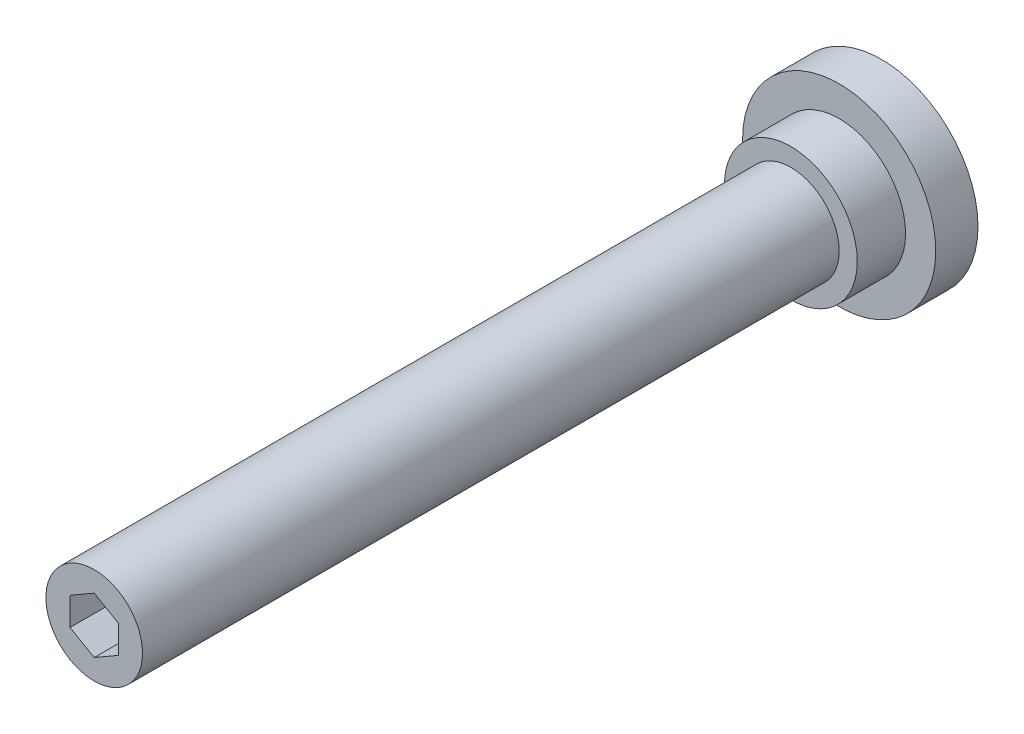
ISO-10303-21;
HEADER;
FILE_DESCRIPTION(('STEP AP214'),'2;1');
FILE_NAME('part.step','',(''),(''),'','','');
FILE_SCHEMA(('AUTOMOTIVE_DESIGN { 1 0 10303 214 1 1 1 1 }'));
ENDSEC;
DATA;
#1=APPLICATION_CONTEXT('core data for automotive mechanical design processes');
#2=APPLICATION_PROTOCOL_DEFINITION('international standard','automotive_design',2000,#1);
#3=PRODUCT_CONTEXT('',#1,'mechanical');
#4=PRODUCT('Part','Part','',(#3));
#5=PRODUCT_RELATED_PRODUCT_CATEGORY('part','',(#4));
#6=PRODUCT_DEFINITION_FORMATION('','',#4);
#7=PRODUCT_DEFINITION_CONTEXT('part definition',#1,'design');
#8=PRODUCT_DEFINITION('design','',#6,#7);
#9=PRODUCT_DEFINITION_SHAPE('','',#8);
#10=(LENGTH_UNIT() NAMED_UNIT(*) SI_UNIT(.MILLI.,.METRE.));
#11=(NAMED_UNIT(*) PLANE_ANGLE_UNIT() SI_UNIT($,.RADIAN.));
#12=(NAMED_UNIT(*) SI_UNIT($,.STERADIAN.) SOLID_ANGLE_UNIT());
#13=UNCERTAINTY_MEASURE_WITH_UNIT(LENGTH_MEASURE(1.E-05),#10,'distance_accuracy_value','');
#14=(GEOMETRIC_REPRESENTATION_CONTEXT(3) GLOBAL_UNCERTAINTY_ASSIGNED_CONTEXT((#13)) GLOBAL_UNIT_ASSIGNED_CONTEXT((#10,
#11,#12)) REPRESENTATION_CONTEXT('',''));
#15=CARTESIAN_POINT('',(0.,0.,0.));
#16=DIRECTION('',(0.,0.,1.));
#17=DIRECTION('',(1.,0.,0.));
#18=AXIS2_PLACEMENT_3D('',#15,#16,#17);
#19=CARTESIAN_POINT('',(0.,0.,130.4));
#20=DIRECTION('',(0.,0.,1.));
#21=DIRECTION('',(1.,0.,0.));
#22=AXIS2_PLACEMENT_3D('',#19,#20,#21);
#23=PLANE('',#22);
#24=DIRECTION('',(-0.866025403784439,0.5,0.));
#25=VECTOR('',#24,1.);
#26=CARTESIAN_POINT('',(4.,2.30940107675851,130.4));
#27=LINE('',#26,#25);
#28=CARTESIAN_POINT('',(4.,2.30940107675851,130.4));
#29=VERTEX_POINT('',#28);
#30=CARTESIAN_POINT('',(0.,4.618802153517,130.4));
#31=VERTEX_POINT('',#30);
#32=EDGE_CURVE('E28',#29,#31,#27,.T.);
#33=ORIENTED_EDGE('',*,*,#32,.F.);
#34=DIRECTION('',(0.,1.,0.));
#35=VECTOR('',#34,1.);
#36=CARTESIAN_POINT('',(4.,-2.3094010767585,130.4));
#37=LINE('',#36,#35);
#38=CARTESIAN_POINT('',(4.,-2.3094010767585,130.4));
#39=VERTEX_POINT('',#38);
#40=EDGE_CURVE('E97',#39,#29,#37,.T.);
#41=ORIENTED_EDGE('',*,*,#40,.F.);
#42=DIRECTION('',(0.866025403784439,0.5,0.));
#43=VECTOR('',#42,1.);
#44=CARTESIAN_POINT('',(0.,-4.618802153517,130.4));
#45=LINE('',#44,#43);
#46=CARTESIAN_POINT('',(0.,-4.618802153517,130.4));
#47=VERTEX_POINT('',#46);
#48=EDGE_CURVE('E91',#47,#39,#45,.T.);
#49=ORIENTED_EDGE('',*,*,#48,.F.);
#50=DIRECTION('',(0.866025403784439,-0.5,0.));
#51=VECTOR('',#50,1.);
#52=CARTESIAN_POINT('',(-4.,-2.3094010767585,130.4));
#53=LINE('',#52,#51);
#54=CARTESIAN_POINT('',(-4.,-2.3094010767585,130.4));
#55=VERTEX_POINT('',#54);
#56=EDGE_CURVE('E89',#55,#47,#53,.T.);
#57=ORIENTED_EDGE('',*,*,#56,.F.);
#58=DIRECTION('',(0.,-1.,0.));
#59=VECTOR('',#58,1.);
#60=CARTESIAN_POINT('',(-4.,2.3094010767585,130.4));
#61=LINE('',#60,#59);
#62=CARTESIAN_POINT('',(-4.,2.3094010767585,130.4));
#63=VERTEX_POINT('',#62);
#64=EDGE_CURVE('E71',#63,#55,#61,.T.);
#65=ORIENTED_EDGE('',*,*,#64,.F.);
#66=DIRECTION('',(-0.866025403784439,-0.5,0.));
#67=VECTOR('',#66,1.);
#68=CARTESIAN_POINT('',(0.,4.618802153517,130.4));
#69=LINE('',#68,#67);
#70=EDGE_CURVE('E82',#31,#63,#69,.T.);
#71=ORIENTED_EDGE('',*,*,#70,.F.);
#72=EDGE_LOOP('',(#33,#41,#49,#57,#65,#71));
#73=FACE_BOUND('',#72,.T.);
#74=CARTESIAN_POINT('',(0.,0.,130.4));
#75=DIRECTION('',(0.,0.,1.));
#76=DIRECTION('',(1.,0.,0.));
#77=AXIS2_PLACEMENT_3D('',#74,#75,#76);
#78=CIRCLE('',#77,8.);
#79=CARTESIAN_POINT('',(8.,0.,130.4));
#80=VERTEX_POINT('',#79);
#81=EDGE_CURVE('E9',#80,#80,#78,.T.);
#82=ORIENTED_EDGE('',*,*,#81,.T.);
#83=EDGE_LOOP('',(#82));
#84=FACE_BOUND('',#83,.T.);
#85=ADVANCED_FACE('F14',(#73,#84),#23,.T.);
#86=CARTESIAN_POINT('',(0.,0.,30.));
#87=DIRECTION('',(0.,0.,1.));
#88=DIRECTION('',(1.,0.,0.));
#89=AXIS2_PLACEMENT_3D('',#86,#87,#88);
#90=CYLINDRICAL_SURFACE('',#89,8.);
#91=CARTESIAN_POINT('',(0.,0.,15.));
#92=DIRECTION('',(0.,0.,1.));
#93=DIRECTION('',(1.,0.,0.));
#94=AXIS2_PLACEMENT_3D('',#91,#92,#93);
#95=CIRCLE('',#94,8.);
#96=CARTESIAN_POINT('',(8.,0.,15.));
#97=VERTEX_POINT('',#96);
#98=EDGE_CURVE('E21',#97,#97,#95,.T.);
#99=ORIENTED_EDGE('',*,*,#98,.T.);
#100=EDGE_LOOP('',(#99));
#101=FACE_BOUND('',#100,.T.);
#102=ORIENTED_EDGE('',*,*,#81,.F.);
#103=EDGE_LOOP('',(#102));
#104=FACE_BOUND('',#103,.T.);
#105=ADVANCED_FACE('F135',(#101,#104),#90,.T.);
#106=CARTESIAN_POINT('',(-8.,0.,15.));
#107=DIRECTION('',(0.,0.,1.));
#108=DIRECTION('',(1.,0.,0.));
#109=AXIS2_PLACEMENT_3D('',#106,#107,#108);
#110=PLANE('',#109);
#111=CARTESIAN_POINT('',(0.,0.,15.));
#112=DIRECTION('',(0.,0.,1.));
#113=DIRECTION('',(1.,0.,0.));
#114=AXIS2_PLACEMENT_3D('',#111,#112,#113);
#115=CIRCLE('',#114,11.);
#116=CARTESIAN_POINT('',(11.,0.,15.));
#117=VERTEX_POINT('',#116);
#118=EDGE_CURVE('E130',#117,#117,#115,.T.);
#119=ORIENTED_EDGE('',*,*,#118,.T.);
#120=EDGE_LOOP('',(#119));
#121=FACE_BOUND('',#120,.T.);
#122=ORIENTED_EDGE('',*,*,#98,.F.);
#123=EDGE_LOOP('',(#122));
#124=FACE_BOUND('',#123,.T.);
#125=ADVANCED_FACE('F138',(#121,#124),#110,.T.);
#126=CARTESIAN_POINT('',(0.,0.,30.));
#127=DIRECTION('',(0.,0.,1.));
#128=DIRECTION('',(1.,0.,0.));
#129=AXIS2_PLACEMENT_3D('',#126,#127,#128);
#130=CYLINDRICAL_SURFACE('',#129,11.);
#131=CARTESIAN_POINT('',(0.,0.,7.));
#132=DIRECTION('',(0.,0.,1.));
#133=DIRECTION('',(1.,0.,0.));
#134=AXIS2_PLACEMENT_3D('',#131,#132,#133);
#135=CIRCLE('',#134,11.);
#136=CARTESIAN_POINT('',(11.,0.,7.));
#137=VERTEX_POINT('',#136);
#138=EDGE_CURVE('E127',#137,#137,#135,.T.);
#139=ORIENTED_EDGE('',*,*,#138,.T.);
#140=EDGE_LOOP('',(#139));
#141=FACE_BOUND('',#140,.T.);
#142=ORIENTED_EDGE('',*,*,#118,.F.);
#143=EDGE_LOOP('',(#142));
#144=FACE_BOUND('',#143,.T.);
#145=ADVANCED_FACE('F140',(#141,#144),#130,.T.);
#146=CARTESIAN_POINT('',(-11.,0.,7.));
#147=DIRECTION('',(0.,0.,1.));
#148=DIRECTION('',(1.,0.,0.));
#149=AXIS2_PLACEMENT_3D('',#146,#147,#148);
#150=PLANE('',#149);
#151=CARTESIAN_POINT('',(0.,0.,7.));
#152=DIRECTION('',(0.,0.,1.));
#153=DIRECTION('',(1.,0.,0.));
#154=AXIS2_PLACEMENT_3D('',#151,#152,#153);
#155=CIRCLE('',#154,16.);
#156=CARTESIAN_POINT('',(16.,0.,7.));
#157=VERTEX_POINT('',#156);
#158=EDGE_CURVE('E124',#157,#157,#155,.T.);
#159=ORIENTED_EDGE('',*,*,#158,.T.);
#160=EDGE_LOOP('',(#159));
#161=FACE_BOUND('',#160,.T.);
#162=ORIENTED_EDGE('',*,*,#138,.F.);
#163=EDGE_LOOP('',(#162));
#164=FACE_BOUND('',#163,.T.);
#165=ADVANCED_FACE('F148',(#161,#164),#150,.T.);
#166=CARTESIAN_POINT('',(0.,0.,30.));
#167=DIRECTION('',(0.,0.,1.));
#168=DIRECTION('',(1.,0.,0.));
#169=AXIS2_PLACEMENT_3D('',#166,#167,#168);
#170=CYLINDRICAL_SURFACE('',#169,16.);
#171=CARTESIAN_POINT('',(0.,0.,0.));
#172=DIRECTION('',(0.,0.,1.));
#173=DIRECTION('',(1.,0.,0.));
#174=AXIS2_PLACEMENT_3D('',#171,#172,#173);
#175=CIRCLE('',#174,16.);
#176=CARTESIAN_POINT('',(16.,0.,0.));
#177=VERTEX_POINT('',#176);
#178=EDGE_CURVE('E115',#177,#177,#175,.T.);
#179=ORIENTED_EDGE('',*,*,#178,.T.);
#180=EDGE_LOOP('',(#179));
#181=FACE_BOUND('',#180,.T.);
#182=ORIENTED_EDGE('',*,*,#158,.F.);
#183=EDGE_LOOP('',(#182));
#184=FACE_BOUND('',#183,.T.);
#185=ADVANCED_FACE('F184',(#181,#184),#170,.T.);
#186=CARTESIAN_POINT('',(-16.,0.,0.));
#187=DIRECTION('',(0.,0.,-1.));
#188=DIRECTION('',(-1.,0.,0.));
#189=AXIS2_PLACEMENT_3D('',#186,#187,#188);
#190=PLANE('',#189);
#191=ORIENTED_EDGE('',*,*,#178,.F.);
#192=EDGE_LOOP('',(#191));
#193=FACE_BOUND('',#192,.T.);
#194=ADVANCED_FACE('F194',(#193),#190,.T.);
#195=CARTESIAN_POINT('',(4.,2.30940107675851,124.4));
#196=DIRECTION('',(0.5,0.866025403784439,0.));
#197=DIRECTION('',(-0.866025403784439,0.5,0.));
#198=AXIS2_PLACEMENT_3D('',#195,#196,#197);
#199=PLANE('',#198);
#200=ORIENTED_EDGE('',*,*,#32,.T.);
#201=DIRECTION('',(0.,0.,1.));
#202=VECTOR('',#201,1.);
#203=CARTESIAN_POINT('',(0.,4.618802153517,124.4));
#204=LINE('',#203,#202);
#205=CARTESIAN_POINT('',(0.,4.618802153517,124.4));
#206=VERTEX_POINT('',#205);
#207=EDGE_CURVE('E79',#206,#31,#204,.T.);
#208=ORIENTED_EDGE('',*,*,#207,.F.);
#209=DIRECTION('',(-0.866025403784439,0.5,0.));
#210=VECTOR('',#209,1.);
#211=CARTESIAN_POINT('',(4.,2.30940107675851,124.4));
#212=LINE('',#211,#210);
#213=CARTESIAN_POINT('',(4.,2.30940107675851,124.4));
#214=VERTEX_POINT('',#213);
#215=EDGE_CURVE('E99',#214,#206,#212,.T.);
#216=ORIENTED_EDGE('',*,*,#215,.F.);
#217=DIRECTION('',(0.,0.,1.));
#218=VECTOR('',#217,1.);
#219=CARTESIAN_POINT('',(4.,2.30940107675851,124.4));
#220=LINE('',#219,#218);
#221=EDGE_CURVE('E35',#214,#29,#220,.T.);
#222=ORIENTED_EDGE('',*,*,#221,.T.);
#223=EDGE_LOOP('',(#200,#208,#216,#222));
#224=FACE_BOUND('',#223,.T.);
#225=ADVANCED_FACE('F204',(#224),#199,.F.);
#226=CARTESIAN_POINT('',(4.,-2.3094010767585,124.4));
#227=DIRECTION('',(1.,0.,0.));
#228=DIRECTION('',(0.,0.,-1.));
#229=AXIS2_PLACEMENT_3D('',#226,#227,#228);
#230=PLANE('',#229);
#231=ORIENTED_EDGE('',*,*,#40,.T.);
#232=ORIENTED_EDGE('',*,*,#221,.F.);
#233=DIRECTION('',(0.,1.,0.));
#234=VECTOR('',#233,1.);
#235=CARTESIAN_POINT('',(4.,-2.3094010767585,124.4));
#236=LINE('',#235,#234);
#237=CARTESIAN_POINT('',(4.,-2.3094010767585,124.4));
#238=VERTEX_POINT('',#237);
#239=EDGE_CURVE('E111',#238,#214,#236,.T.);
#240=ORIENTED_EDGE('',*,*,#239,.F.);
#241=DIRECTION('',(0.,0.,1.));
#242=VECTOR('',#241,1.);
#243=CARTESIAN_POINT('',(4.,-2.3094010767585,124.4));
#244=LINE('',#243,#242);
#245=EDGE_CURVE('E116',#238,#39,#244,.T.);
#246=ORIENTED_EDGE('',*,*,#245,.T.);
#247=EDGE_LOOP('',(#231,#232,#240,#246));
#248=FACE_BOUND('',#247,.T.);
#249=ADVANCED_FACE('F214',(#248),#230,.F.);
#250=CARTESIAN_POINT('',(0.,-4.618802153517,124.4));
#251=DIRECTION('',(0.5,-0.866025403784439,0.));
#252=DIRECTION('',(0.866025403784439,0.5,0.));
#253=AXIS2_PLACEMENT_3D('',#250,#251,#252);
#254=PLANE('',#253);
#255=ORIENTED_EDGE('',*,*,#48,.T.);
#256=ORIENTED_EDGE('',*,*,#245,.F.);
#257=DIRECTION('',(0.866025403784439,0.5,0.));
#258=VECTOR('',#257,1.);
#259=CARTESIAN_POINT('',(0.,-4.618802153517,124.4));
#260=LINE('',#259,#258);
#261=CARTESIAN_POINT('',(0.,-4.618802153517,124.4));
#262=VERTEX_POINT('',#261);
#263=EDGE_CURVE('E108',#262,#238,#260,.T.);
#264=ORIENTED_EDGE('',*,*,#263,.F.);
#265=DIRECTION('',(0.,0.,1.));
#266=VECTOR('',#265,1.);
#267=CARTESIAN_POINT('',(0.,-4.618802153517,124.4));
#268=LINE('',#267,#266);
#269=EDGE_CURVE('E118',#262,#47,#268,.T.);
#270=ORIENTED_EDGE('',*,*,#269,.T.);
#271=EDGE_LOOP('',(#255,#256,#264,#270));
#272=FACE_BOUND('',#271,.T.);
#273=ADVANCED_FACE('F223',(#272),#254,.F.);
#274=CARTESIAN_POINT('',(-4.,-2.3094010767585,124.4));
#275=DIRECTION('',(-0.5,-0.866025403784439,0.));
#276=DIRECTION('',(0.866025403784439,-0.5,0.));
#277=AXIS2_PLACEMENT_3D('',#274,#275,#276);
#278=PLANE('',#277);
#279=ORIENTED_EDGE('',*,*,#56,.T.);
#280=ORIENTED_EDGE('',*,*,#269,.F.);
#281=DIRECTION('',(0.866025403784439,-0.5,0.));
#282=VECTOR('',#281,1.);
#283=CARTESIAN_POINT('',(-4.,-2.3094010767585,124.4));
#284=LINE('',#283,#282);
#285=CARTESIAN_POINT('',(-4.,-2.3094010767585,124.4));
#286=VERTEX_POINT('',#285);
#287=EDGE_CURVE('E105',#286,#262,#284,.T.);
#288=ORIENTED_EDGE('',*,*,#287,.F.);
#289=DIRECTION('',(0.,0.,1.));
#290=VECTOR('',#289,1.);
#291=CARTESIAN_POINT('',(-4.,-2.3094010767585,124.4));
#292=LINE('',#291,#290);
#293=EDGE_CURVE('E78',#286,#55,#292,.T.);
#294=ORIENTED_EDGE('',*,*,#293,.T.);
#295=EDGE_LOOP('',(#279,#280,#288,#294));
#296=FACE_BOUND('',#295,.T.);
#297=ADVANCED_FACE('F232',(#296),#278,.F.);
#298=CARTESIAN_POINT('',(-4.,2.3094010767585,124.4));
#299=DIRECTION('',(-1.,0.,0.));
#300=DIRECTION('',(0.,-1.,0.));
#301=AXIS2_PLACEMENT_3D('',#298,#299,#300);
#302=PLANE('',#301);
#303=ORIENTED_EDGE('',*,*,#64,.T.);
#304=ORIENTED_EDGE('',*,*,#293,.F.);
#305=DIRECTION('',(0.,-1.,0.));
#306=VECTOR('',#305,1.);
#307=CARTESIAN_POINT('',(-4.,2.3094010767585,124.4));
#308=LINE('',#307,#306);
#309=CARTESIAN_POINT('',(-4.,2.3094010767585,124.4));
#310=VERTEX_POINT('',#309);
#311=EDGE_CURVE('E74',#310,#286,#308,.T.);
#312=ORIENTED_EDGE('',*,*,#311,.F.);
#313=DIRECTION('',(0.,0.,1.));
#314=VECTOR('',#313,1.);
#315=CARTESIAN_POINT('',(-4.,2.3094010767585,124.4));
#316=LINE('',#315,#314);
#317=EDGE_CURVE('E67',#310,#63,#316,.T.);
#318=ORIENTED_EDGE('',*,*,#317,.T.);
#319=EDGE_LOOP('',(#303,#304,#312,#318));
#320=FACE_BOUND('',#319,.T.);
#321=ADVANCED_FACE('F69',(#320),#302,.F.);
#322=CARTESIAN_POINT('',(0.,4.618802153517,124.4));
#323=DIRECTION('',(-0.5,0.866025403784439,0.));
#324=DIRECTION('',(-0.866025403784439,-0.5,0.));
#325=AXIS2_PLACEMENT_3D('',#322,#323,#324);
#326=PLANE('',#325);
#327=ORIENTED_EDGE('',*,*,#70,.T.);
#328=ORIENTED_EDGE('',*,*,#317,.F.);
#329=DIRECTION('',(-0.866025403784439,-0.5,0.));
#330=VECTOR('',#329,1.);
#331=CARTESIAN_POINT('',(0.,4.618802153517,124.4));
#332=LINE('',#331,#330);
#333=EDGE_CURVE('E102',#206,#310,#332,.T.);
#334=ORIENTED_EDGE('',*,*,#333,.F.);
#335=ORIENTED_EDGE('',*,*,#207,.T.);
#336=EDGE_LOOP('',(#327,#328,#334,#335));
#337=FACE_BOUND('',#336,.T.);
#338=ADVANCED_FACE('F83',(#337),#326,.F.);
#339=CARTESIAN_POINT('',(4.,2.30940107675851,124.4));
#340=DIRECTION('',(0.,0.,-1.));
#341=DIRECTION('',(-1.,0.,0.));
#342=AXIS2_PLACEMENT_3D('',#339,#340,#341);
#343=PLANE('',#342);
#344=ORIENTED_EDGE('',*,*,#215,.T.);
#345=ORIENTED_EDGE('',*,*,#333,.T.);
#346=ORIENTED_EDGE('',*,*,#311,.T.);
#347=ORIENTED_EDGE('',*,*,#287,.T.);
#348=ORIENTED_EDGE('',*,*,#263,.T.);
#349=ORIENTED_EDGE('',*,*,#239,.T.);
#350=EDGE_LOOP('',(#344,#345,#346,#347,#348,#349));
#351=FACE_BOUND('',#350,.T.);
#352=ADVANCED_FACE('F259',(#351),#343,.F.);
#353=CLOSED_SHELL('',(#85,#105,#125,#145,#165,#185,#194,#225,#249,#273,#297,#321,#338,#352));
#354=MANIFOLD_SOLID_BREP('B1',#353);
#355=ADVANCED_BREP_SHAPE_REPRESENTATION('',(#18,#354),#14);
#356=SHAPE_DEFINITION_REPRESENTATION(#9,#355);
ENDSEC;
END-ISO-10303-21;
